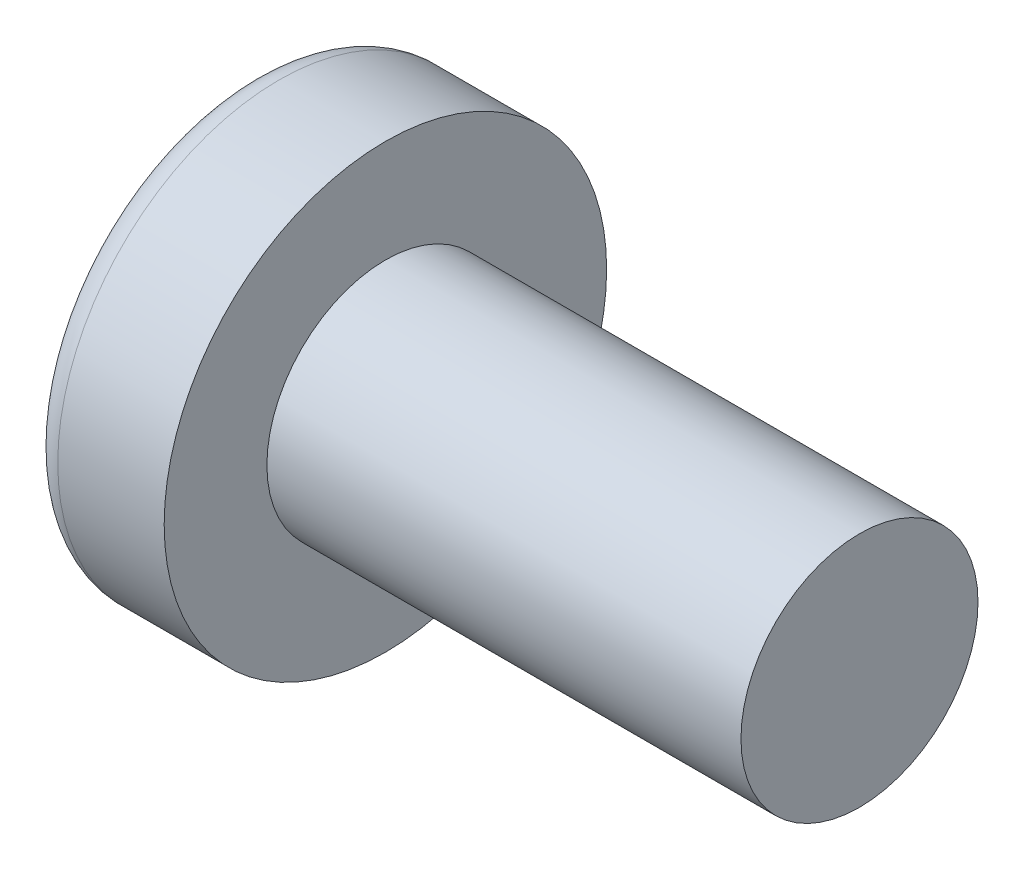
from build123d import *

# Parameters (mm, degrees)
CIRPATTERN1_COUNT = 2
CIRPATTERN1_ANGLE = 90


with BuildPart() as part:
    # BodySke → Base-Revolve (revolve)
    with BuildSketch(Plane.XY, mode=Mode.PRIVATE) as base_revolve_sk:
        with BuildLine():
            Line((2.4, 1.5), (2.4, 2.8))
            Line((2.4, 2.8), (1.053355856, 2.8))
            ThreePointArc((1.053355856, 2.8), (0.878072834, 2.754445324), (0.747150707, 2.629310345))
            ThreePointArc((0.747150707, 2.629310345), (0.190413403, 1.366702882), (0, 0))
            Line((0, 0), (8.4, 0))
            Line((8.4, 0), (8.4, 1.5))
            Line((8.4, 1.5), (2.4, 1.5))
        make_face()
    revolve(base_revolve_sk.sketch.rotate(Axis((-25.4, 0, 0), (1, 0, 0)), 90), axis=Axis((-25.4, 0, 0), (1, 0, 0)))

    # Sketch3 → Cut-Loft1 section 0
    with BuildSketch(Plane(origin=(0, 0, 0), x_dir=(0, 0, -1), z_dir=(1, 0, 0))):
        with BuildLine():
            Line((0.37, -1.45), (-0.37, -1.45))
            Line((-0.37, -1.45), (-0.37, 1.45))
            Line((-0.37, 1.45), (0.37, 1.45))
            Line((0.37, 1.45), (0.37, -1.45))
        make_face()
    # Sketch4 → Cut-Loft1 section 1
    with BuildSketch(Plane(origin=(1.76, 0, 0), x_dir=(0, 0, -1), z_dir=(1, 0, 0))):
        with BuildLine():
            Line((0.185, -0.185), (-0.185, -0.185))
            Line((-0.185, -0.185), (-0.185, 0.185))
            Line((-0.185, 0.185), (0.185, 0.185))
            Line((0.185, 0.185), (0.185, -0.185))
        make_face()
    cut_loft1 = loft(mode=Mode.SUBTRACT)

    # CirPattern1: Cut-Loft1 ×2 about axis
    cirpattern1_axis = Axis((0, 0, 0), (1, 0, 0))
    for i in range(1, CIRPATTERN1_COUNT):
        add(cut_loft1.rotate(cirpattern1_axis, i * CIRPATTERN1_ANGLE / (CIRPATTERN1_COUNT - 1)), mode=Mode.SUBTRACT)


solid = part.part
